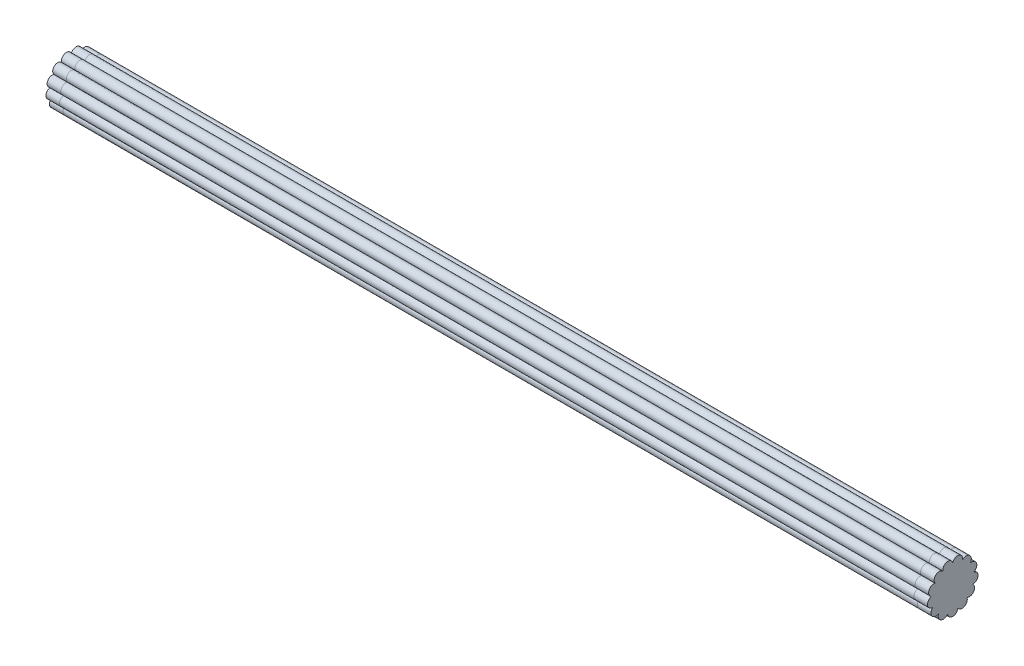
from build123d import *

# Parameters (mm, degrees)
SALIENTE_EXTRUIR1_DEPTH      = 630
SALIENTE_EXTRUIR1_DEPTH_BACK = 630
SALIENTE_EXTRUIR2_DEPTH      = 630
SALIENTE_EXTRUIR2_DEPTH_BACK = 630
CROQUIS3_R                   = 7.5
SALIENTE_EXTRUIR3_DEPTH      = 20


with BuildPart() as part:
    # Croquis2 → Saliente-Extruir1 (new, two sides: drawn at the far end of the back side and taken through both)
    with BuildSketch(Plane(origin=(0, 0, 0), x_dir=(0, 0, -1), z_dir=(1, 0, 0)).offset(-SALIENTE_EXTRUIR1_DEPTH_BACK)):
        with BuildLine():
            ThreePointArc((7.489959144, -30.387958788), (0, -22.5), (-7.489959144, -30.387958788))
            ThreePointArc((-7.489959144, -30.387958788), (-17.427118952, -33.204600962), (-20.754018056, -23.426443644))
            ThreePointArc((-20.754018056, -23.426443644), (-30.861894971, -21.302428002), (-29.263581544, -11.098212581))
            ThreePointArc((-29.263581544, -11.098212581), (-37.226582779, -4.52012551), (-31.069211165, 3.772485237))
            ThreePointArc((-31.069211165, 3.772485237), (-35.063109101, 13.297683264), (-25.757258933, 17.77895215))
            ThreePointArc((-25.757258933, 17.77895215), (-24.867099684, 28.069153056), (-14.544629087, 27.712475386))
            ThreePointArc((-14.544629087, 27.712475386), (-8.974337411, 36.410318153), (0, 31.297404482))
            ThreePointArc((0, 31.297404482), (8.974337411, 36.410318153), (14.544629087, 27.712475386))
            ThreePointArc((14.544629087, 27.712475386), (24.867099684, 28.069153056), (25.757258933, 17.77895215))
            ThreePointArc((25.757258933, 17.77895215), (35.063109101, 13.297683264), (31.069211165, 3.772485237))
            ThreePointArc((31.069211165, 3.772485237), (37.226582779, -4.52012551), (29.263581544, -11.098212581))
            ThreePointArc((29.263581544, -11.098212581), (30.861894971, -21.302428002), (20.754018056, -23.426443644))
            ThreePointArc((20.754018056, -23.426443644), (17.427118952, -33.204600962), (7.489959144, -30.387958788))
        make_face()
    extrude(amount=SALIENTE_EXTRUIR1_DEPTH + SALIENTE_EXTRUIR1_DEPTH_BACK)


with BuildPart() as body_2:
    # Croquis3 → Saliente-Extruir2 (new, two sides: drawn at the far end of the back side and taken through both)
    with BuildSketch(Plane(origin=(0, 0, 0), x_dir=(0, 0, -1), z_dir=(1, 0, 0)).offset(-SALIENTE_EXTRUIR2_DEPTH_BACK)):
        with Locations((0, -30)):
            Circle(CROQUIS3_R)
    extrude(amount=SALIENTE_EXTRUIR2_DEPTH + SALIENTE_EXTRUIR2_DEPTH_BACK)


with BuildPart() as body_3:
    # Croquis4 → Saliente-Extruir3 (new body)
    with BuildSketch(Plane.ZY.offset(630)):
        with BuildLine():
            ThreePointArc((-7.489959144, -30.387958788), (0, -37.5), (7.489959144, -30.387958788))
            ThreePointArc((7.489959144, -30.387958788), (17.427118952, -33.204600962), (20.754018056, -23.426443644))
            ThreePointArc((20.754018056, -23.426443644), (30.861894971, -21.302428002), (29.263581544, -11.098212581))
            ThreePointArc((29.263581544, -11.098212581), (37.226582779, -4.52012551), (31.069211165, 3.772485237))
            ThreePointArc((31.069211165, 3.772485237), (35.063109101, 13.297683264), (25.757258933, 17.77895215))
            ThreePointArc((25.757258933, 17.77895215), (24.867099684, 28.069153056), (14.544629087, 27.712475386))
            ThreePointArc((14.544629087, 27.712475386), (8.974337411, 36.410318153), (0, 31.297404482))
            ThreePointArc((0, 31.297404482), (-8.974337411, 36.410318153), (-14.544629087, 27.712475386))
            ThreePointArc((-14.544629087, 27.712475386), (-24.867099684, 28.069153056), (-25.757258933, 17.77895215))
            ThreePointArc((-25.757258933, 17.77895215), (-35.063109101, 13.297683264), (-31.069211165, 3.772485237))
            ThreePointArc((-31.069211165, 3.772485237), (-37.226582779, -4.52012551), (-29.263581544, -11.098212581))
            ThreePointArc((-29.263581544, -11.098212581), (-30.861894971, -21.302428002), (-20.754018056, -23.426443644))
            ThreePointArc((-20.754018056, -23.426443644), (-17.427118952, -33.204600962), (-7.489959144, -30.387958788))
        make_face()
    extrude(amount=SALIENTE_EXTRUIR3_DEPTH)


with BuildPart() as body_4:
    # Simetr_a2: mirrored copy
    add(body_3.part.mirror(Plane(origin=(0, 0, 0), x_dir=(0, 0, 1), z_dir=(1, 0, 0))))


solid = Compound([part.part, body_2.part, body_3.part, body_4.part])
